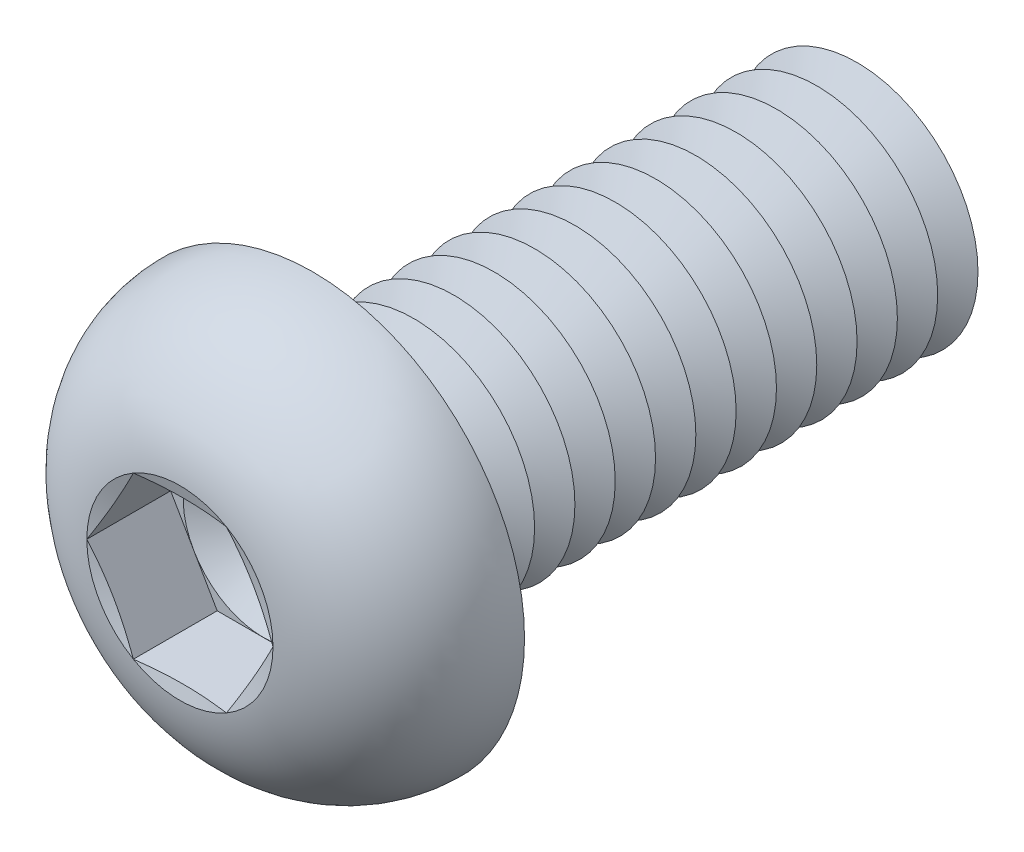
ISO-10303-21;
HEADER;
FILE_DESCRIPTION(('STEP AP214'),'2;1');
FILE_NAME('part.step','',(''),(''),'','','');
FILE_SCHEMA(('AUTOMOTIVE_DESIGN { 1 0 10303 214 1 1 1 1 }'));
ENDSEC;
DATA;
#1=APPLICATION_CONTEXT('core data for automotive mechanical design processes');
#2=APPLICATION_PROTOCOL_DEFINITION('international standard','automotive_design',2000,#1);
#3=PRODUCT_CONTEXT('',#1,'mechanical');
#4=PRODUCT('Part','Part','',(#3));
#5=PRODUCT_RELATED_PRODUCT_CATEGORY('part','',(#4));
#6=PRODUCT_DEFINITION_FORMATION('','',#4);
#7=PRODUCT_DEFINITION_CONTEXT('part definition',#1,'design');
#8=PRODUCT_DEFINITION('design','',#6,#7);
#9=PRODUCT_DEFINITION_SHAPE('','',#8);
#10=(LENGTH_UNIT() NAMED_UNIT(*) SI_UNIT(.MILLI.,.METRE.));
#11=(NAMED_UNIT(*) PLANE_ANGLE_UNIT() SI_UNIT($,.RADIAN.));
#12=(NAMED_UNIT(*) SI_UNIT($,.STERADIAN.) SOLID_ANGLE_UNIT());
#13=UNCERTAINTY_MEASURE_WITH_UNIT(LENGTH_MEASURE(1.E-05),#10,'distance_accuracy_value','');
#14=(GEOMETRIC_REPRESENTATION_CONTEXT(3) GLOBAL_UNCERTAINTY_ASSIGNED_CONTEXT((#13)) GLOBAL_UNIT_ASSIGNED_CONTEXT((#10,
#11,#12)) REPRESENTATION_CONTEXT('',''));
#15=CARTESIAN_POINT('',(0.,0.,0.));
#16=DIRECTION('',(0.,0.,1.));
#17=DIRECTION('',(1.,0.,0.));
#18=AXIS2_PLACEMENT_3D('',#15,#16,#17);
#19=CARTESIAN_POINT('',(0.,0.,1.22));
#20=DIRECTION('',(0.,0.,1.));
#21=DIRECTION('',(1.,0.,0.));
#22=AXIS2_PLACEMENT_3D('',#19,#20,#21);
#23=PLANE('',#22);
#24=CARTESIAN_POINT('',(0.,0.,1.22));
#25=DIRECTION('',(0.,0.,1.));
#26=DIRECTION('',(1.,0.,0.));
#27=AXIS2_PLACEMENT_3D('',#24,#25,#26);
#28=CIRCLE('',#27,1.99999906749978);
#29=CARTESIAN_POINT('',(1.73205,0.999999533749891,1.22));
#30=VERTEX_POINT('',#29);
#31=CARTESIAN_POINT('',(0.,1.99999906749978,1.22));
#32=VERTEX_POINT('',#31);
#33=EDGE_CURVE('E118',#30,#32,#28,.T.);
#34=ORIENTED_EDGE('',*,*,#33,.F.);
#35=DIRECTION('',(-0.5,0.866025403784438,0.));
#36=VECTOR('',#35,1.);
#37=CARTESIAN_POINT('',(2.3094,0.,1.22));
#38=LINE('',#37,#36);
#39=CARTESIAN_POINT('',(1.1547,1.99999906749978,1.22));
#40=VERTEX_POINT('',#39);
#41=EDGE_CURVE('E125',#30,#40,#38,.T.);
#42=ORIENTED_EDGE('',*,*,#41,.T.);
#43=DIRECTION('',(-1.,0.,0.));
#44=VECTOR('',#43,1.);
#45=CARTESIAN_POINT('',(1.1547,1.99999906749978,1.22));
#46=LINE('',#45,#44);
#47=EDGE_CURVE('E136',#40,#32,#46,.T.);
#48=ORIENTED_EDGE('',*,*,#47,.T.);
#49=EDGE_LOOP('',(#34,#42,#48));
#50=FACE_BOUND('',#49,.T.);
#51=ADVANCED_FACE('F39',(#50),#23,.T.);
#52=CARTESIAN_POINT('',(0.,0.,1.22));
#53=DIRECTION('',(0.,0.,1.));
#54=DIRECTION('',(1.,0.,0.));
#55=AXIS2_PLACEMENT_3D('',#52,#53,#54);
#56=CIRCLE('',#55,1.99999906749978);
#57=CARTESIAN_POINT('',(-1.73205,0.999999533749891,1.22));
#58=VERTEX_POINT('',#57);
#59=EDGE_CURVE('E11',#32,#58,#56,.T.);
#60=ORIENTED_EDGE('',*,*,#59,.F.);
#61=CARTESIAN_POINT('',(-1.1547,1.99999906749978,1.22));
#62=VERTEX_POINT('',#61);
#63=EDGE_CURVE('E131',#32,#62,#46,.T.);
#64=ORIENTED_EDGE('',*,*,#63,.T.);
#65=DIRECTION('',(-0.5,-0.866025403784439,0.));
#66=VECTOR('',#65,1.);
#67=CARTESIAN_POINT('',(-1.1547,1.99999906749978,1.22));
#68=LINE('',#67,#66);
#69=EDGE_CURVE('E134',#62,#58,#68,.T.);
#70=ORIENTED_EDGE('',*,*,#69,.T.);
#71=EDGE_LOOP('',(#60,#64,#70));
#72=FACE_BOUND('',#71,.T.);
#73=ADVANCED_FACE('F130',(#72),#23,.T.);
#74=CARTESIAN_POINT('',(-1.73205,-0.999999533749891,1.22));
#75=VERTEX_POINT('',#74);
#76=EDGE_CURVE('E49',#58,#75,#56,.T.);
#77=ORIENTED_EDGE('',*,*,#76,.F.);
#78=CARTESIAN_POINT('',(-2.3094,0.,1.22));
#79=VERTEX_POINT('',#78);
#80=EDGE_CURVE('E143',#58,#79,#68,.T.);
#81=ORIENTED_EDGE('',*,*,#80,.T.);
#82=DIRECTION('',(0.5,-0.866025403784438,0.));
#83=VECTOR('',#82,1.);
#84=CARTESIAN_POINT('',(-2.3094,0.,1.22));
#85=LINE('',#84,#83);
#86=EDGE_CURVE('E152',#79,#75,#85,.T.);
#87=ORIENTED_EDGE('',*,*,#86,.T.);
#88=EDGE_LOOP('',(#77,#81,#87));
#89=FACE_BOUND('',#88,.T.);
#90=ADVANCED_FACE('F380',(#89),#23,.T.);
#91=CARTESIAN_POINT('',(0.,-1.99999906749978,1.22));
#92=VERTEX_POINT('',#91);
#93=EDGE_CURVE('E364',#75,#92,#56,.T.);
#94=ORIENTED_EDGE('',*,*,#93,.F.);
#95=CARTESIAN_POINT('',(-1.1547,-1.99999906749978,1.22));
#96=VERTEX_POINT('',#95);
#97=EDGE_CURVE('E151',#75,#96,#85,.T.);
#98=ORIENTED_EDGE('',*,*,#97,.T.);
#99=DIRECTION('',(1.,0.,0.));
#100=VECTOR('',#99,1.);
#101=CARTESIAN_POINT('',(-1.1547,-1.99999906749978,1.22));
#102=LINE('',#101,#100);
#103=EDGE_CURVE('E157',#96,#92,#102,.T.);
#104=ORIENTED_EDGE('',*,*,#103,.T.);
#105=EDGE_LOOP('',(#94,#98,#104));
#106=FACE_BOUND('',#105,.T.);
#107=ADVANCED_FACE('F374',(#106),#23,.T.);
#108=CARTESIAN_POINT('',(1.73205,-0.999999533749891,1.22));
#109=VERTEX_POINT('',#108);
#110=EDGE_CURVE('E56',#92,#109,#56,.T.);
#111=ORIENTED_EDGE('',*,*,#110,.F.);
#112=CARTESIAN_POINT('',(1.1547,-1.99999906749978,1.22));
#113=VERTEX_POINT('',#112);
#114=EDGE_CURVE('E156',#92,#113,#102,.T.);
#115=ORIENTED_EDGE('',*,*,#114,.T.);
#116=DIRECTION('',(0.5,0.866025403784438,0.));
#117=VECTOR('',#116,1.);
#118=CARTESIAN_POINT('',(1.1547,-1.99999906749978,1.22));
#119=LINE('',#118,#117);
#120=EDGE_CURVE('E162',#113,#109,#119,.T.);
#121=ORIENTED_EDGE('',*,*,#120,.T.);
#122=EDGE_LOOP('',(#111,#115,#121));
#123=FACE_BOUND('',#122,.T.);
#124=ADVANCED_FACE('F452',(#123),#23,.T.);
#125=CARTESIAN_POINT('',(0.,0.,3.3));
#126=DIRECTION('',(0.,0.,1.));
#127=DIRECTION('',(1.,0.,0.));
#128=AXIS2_PLACEMENT_3D('',#125,#126,#127);
#129=CONICAL_SURFACE('',#128,2.3094,1.30899693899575);
#130=CARTESIAN_POINT('',(2.30951547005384,-0.000199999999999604,3.30003094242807));
#131=CARTESIAN_POINT('',(2.26155412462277,0.0828714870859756,3.2871729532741));
#132=CARTESIAN_POINT('',(2.21350580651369,0.16609361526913,3.27549992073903));
#133=CARTESIAN_POINT('',(2.11723944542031,0.332831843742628,3.2549913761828));
#134=CARTESIAN_POINT('',(2.06902134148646,0.416348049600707,3.24615701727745));
#135=CARTESIAN_POINT('',(1.97270782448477,0.583167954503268,3.23184167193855));
#136=CARTESIAN_POINT('',(1.92461306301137,0.666470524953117,3.22634360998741));
#137=CARTESIAN_POINT('',(1.82836219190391,0.83318192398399,3.21897125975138));
#138=CARTESIAN_POINT('',(1.78020609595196,0.91659072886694,3.21709626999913));
#139=CARTESIAN_POINT('',(1.68389390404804,1.08340833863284,3.21709626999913));
#140=CARTESIAN_POINT('',(1.63573780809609,1.16681714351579,3.21897125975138));
#141=CARTESIAN_POINT('',(1.53948693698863,1.33352854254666,3.22634360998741));
#142=CARTESIAN_POINT('',(1.49139217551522,1.41683111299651,3.23184167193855));
#143=CARTESIAN_POINT('',(1.39507865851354,1.58365101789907,3.24615701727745));
#144=CARTESIAN_POINT('',(1.34686055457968,1.66716722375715,3.2549913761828));
#145=CARTESIAN_POINT('',(1.25059419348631,1.83390545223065,3.27549992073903));
#146=CARTESIAN_POINT('',(1.20254587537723,1.91712758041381,3.2871729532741));
#147=CARTESIAN_POINT('',(1.15458452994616,2.00019906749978,3.30003094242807));
#148=B_SPLINE_CURVE_WITH_KNOTS('',3,(#130,#131,#132,#133,#134,#135,#136,#137,#138,#139,#140,
#141,#142,#143,#144,#145,#146,#147),.UNSPECIFIED.,.F.,.F.,(4,2,2,2,2,2,2,2,4),(0.,
0.290357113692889,0.580832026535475,0.869807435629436,1.15872689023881,1.44764634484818,
1.73662175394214,2.02709666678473,2.31745378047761),.UNSPECIFIED.);
#149=CARTESIAN_POINT('',(2.3094,0.,3.3));
#150=VERTEX_POINT('',#149);
#151=CARTESIAN_POINT('',(1.15469999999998,1.99999906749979,3.3));
#152=VERTEX_POINT('',#151);
#153=EDGE_CURVE('E221',#150,#152,#148,.T.);
#154=ORIENTED_EDGE('',*,*,#153,.F.);
#155=CARTESIAN_POINT('',(0.,0.,3.3));
#156=DIRECTION('',(0.,0.,-1.));
#157=DIRECTION('',(-1.,0.,0.));
#158=AXIS2_PLACEMENT_3D('',#155,#156,#157);
#159=CIRCLE('',#158,2.3094);
#160=EDGE_CURVE('E409',#152,#150,#159,.T.);
#161=ORIENTED_EDGE('',*,*,#160,.F.);
#162=EDGE_LOOP('',(#154,#161));
#163=FACE_BOUND('',#162,.T.);
#164=ADVANCED_FACE('F456',(#163),#129,.F.);
#165=CARTESIAN_POINT('',(1.15458452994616,-2.00019906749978,3.30003094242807));
#166=CARTESIAN_POINT('',(1.20254587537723,-1.91712758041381,3.2871729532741));
#167=CARTESIAN_POINT('',(1.25059419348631,-1.83390545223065,3.27549992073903));
#168=CARTESIAN_POINT('',(1.34686055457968,-1.66716722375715,3.2549913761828));
#169=CARTESIAN_POINT('',(1.39507865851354,-1.58365101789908,3.24615701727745));
#170=CARTESIAN_POINT('',(1.49139217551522,-1.41683111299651,3.23184167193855));
#171=CARTESIAN_POINT('',(1.53948693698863,-1.33352854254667,3.22634360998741));
#172=CARTESIAN_POINT('',(1.63573780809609,-1.16681714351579,3.21897125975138));
#173=CARTESIAN_POINT('',(1.68389390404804,-1.08340833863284,3.21709626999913));
#174=CARTESIAN_POINT('',(1.78020609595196,-0.916590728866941,3.21709626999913));
#175=CARTESIAN_POINT('',(1.82836219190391,-0.833181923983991,3.21897125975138));
#176=CARTESIAN_POINT('',(1.92461306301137,-0.666470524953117,3.22634360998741));
#177=CARTESIAN_POINT('',(1.97270782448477,-0.583167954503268,3.23184167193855));
#178=CARTESIAN_POINT('',(2.06902134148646,-0.416348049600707,3.24615701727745));
#179=CARTESIAN_POINT('',(2.11723944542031,-0.332831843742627,3.2549913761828));
#180=CARTESIAN_POINT('',(2.21350580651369,-0.166093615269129,3.27549992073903));
#181=CARTESIAN_POINT('',(2.26155412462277,-0.0828714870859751,3.2871729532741));
#182=CARTESIAN_POINT('',(2.30951547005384,0.000200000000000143,3.30003094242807));
#183=B_SPLINE_CURVE_WITH_KNOTS('',3,(#165,#166,#167,#168,#169,#170,#171,#172,#173,#174,#175,
#176,#177,#178,#179,#180,#181,#182),.UNSPECIFIED.,.F.,.F.,(4,2,2,2,2,2,2,2,4),(0.,
0.290357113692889,0.580832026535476,0.869807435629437,1.15872689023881,1.44764634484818,
1.73662175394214,2.02709666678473,2.31745378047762),.UNSPECIFIED.);
#184=CARTESIAN_POINT('',(1.1547,-1.99999906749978,3.3));
#185=VERTEX_POINT('',#184);
#186=EDGE_CURVE('E230',#185,#150,#183,.T.);
#187=ORIENTED_EDGE('',*,*,#186,.F.);
#188=EDGE_CURVE('E411',#150,#185,#159,.T.);
#189=ORIENTED_EDGE('',*,*,#188,.F.);
#190=EDGE_LOOP('',(#187,#189));
#191=FACE_BOUND('',#190,.T.);
#192=ADVANCED_FACE('F416',(#191),#129,.F.);
#193=CARTESIAN_POINT('',(-3.4849337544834,-1.99999906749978,3.75783251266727));
#194=CARTESIAN_POINT('',(-3.40057136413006,-1.99999906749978,3.73822859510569));
#195=CARTESIAN_POINT('',(-3.31617090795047,-1.99999906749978,3.71878852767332));
#196=CARTESIAN_POINT('',(-3.14727791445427,-1.99999906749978,3.68030638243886));
#197=CARTESIAN_POINT('',(-3.06278537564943,-1.99999906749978,3.66126431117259));
#198=CARTESIAN_POINT('',(-2.80911712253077,-1.99999906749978,3.60483420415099));
#199=CARTESIAN_POINT('',(-2.63978343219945,-1.99999906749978,3.5681499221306));
#200=CARTESIAN_POINT('',(-2.29895421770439,-1.99999906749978,3.49717072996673));
#201=CARTESIAN_POINT('',(-2.12745330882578,-1.99999906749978,3.4629014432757));
#202=CARTESIAN_POINT('',(-1.78364663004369,-1.99999906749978,3.39849485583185));
#203=CARTESIAN_POINT('',(-1.61134079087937,-1.99999906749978,3.36835791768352));
#204=CARTESIAN_POINT('',(-1.27040784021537,-1.99999906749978,3.31501553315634));
#205=CARTESIAN_POINT('',(-1.10180724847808,-1.99999906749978,3.291644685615));
#206=CARTESIAN_POINT('',(-0.763641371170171,-1.99999906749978,3.2533727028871));
#207=CARTESIAN_POINT('',(-0.594076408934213,-1.99999906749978,3.23846888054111));
#208=CARTESIAN_POINT('',(-0.339649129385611,-1.99999906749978,3.22431372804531));
#209=CARTESIAN_POINT('',(-0.255009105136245,-1.99999906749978,3.22096057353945));
#210=CARTESIAN_POINT('',(-0.0856618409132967,-1.99999906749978,3.21711210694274));
#211=CARTESIAN_POINT('',(-0.000954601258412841,-1.99999906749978,3.2166167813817));
#212=CARTESIAN_POINT('',(0.168430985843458,-1.99999906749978,3.21851478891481));
#213=CARTESIAN_POINT('',(0.25310933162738,-1.99999906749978,3.2209082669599));
#214=CARTESIAN_POINT('',(0.422344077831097,-1.99999906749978,3.22845792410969));
#215=CARTESIAN_POINT('',(0.506900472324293,-1.99999906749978,3.23361423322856));
#216=CARTESIAN_POINT('',(0.712240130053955,-1.99999906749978,3.24921577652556));
#217=CARTESIAN_POINT('',(0.832922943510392,-1.99999906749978,3.26098285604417));
#218=CARTESIAN_POINT('',(1.07378161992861,-1.99999906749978,3.28874908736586));
#219=CARTESIAN_POINT('',(1.1939575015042,-1.99999906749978,3.30474808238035));
#220=CARTESIAN_POINT('',(1.43419655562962,-1.99999906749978,3.34009172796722));
#221=CARTESIAN_POINT('',(1.55425817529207,-1.99999906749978,3.35944677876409));
#222=CARTESIAN_POINT('',(1.79394991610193,-1.99999906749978,3.40067076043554));
#223=CARTESIAN_POINT('',(1.91358001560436,-1.99999906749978,3.42253981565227));
#224=CARTESIAN_POINT('',(2.15493405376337,-1.99999906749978,3.46864194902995));
#225=CARTESIAN_POINT('',(2.27665041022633,-1.99999906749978,3.49291441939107));
#226=CARTESIAN_POINT('',(2.51977680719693,-1.99999906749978,3.54294628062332));
#227=CARTESIAN_POINT('',(2.64118684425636,-1.99999906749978,3.56870568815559));
#228=CARTESIAN_POINT('',(2.88310060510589,-1.99999906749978,3.62120891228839));
#229=CARTESIAN_POINT('',(3.00360566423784,-1.99999906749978,3.6479466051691));
#230=CARTESIAN_POINT('',(3.24441021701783,-1.99999906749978,3.7022947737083));
#231=CARTESIAN_POINT('',(3.36470972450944,-1.99999906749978,3.72990518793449));
#232=CARTESIAN_POINT('',(3.4849337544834,-1.99999906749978,3.75783251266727));
#233=B_SPLINE_CURVE_WITH_KNOTS('',3,(#193,#194,#195,#196,#197,#198,#199,#200,#201,#202,#203,
#204,#205,#206,#207,#208,#209,#210,#211,#212,#213,#214,#215,#216,#217,#218,#219,#220,#221,#222,
#223,#224,#225,#226,#227,#228,#229,#230,#231,#232),.UNSPECIFIED.,.F.,.F.,(4,2,2,2,2,2,2,2,2,2,2,
2,2,2,2,2,2,2,2,4),(0.,0.259830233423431,0.519664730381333,1.03943435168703,1.56407662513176,
2.08876490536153,2.59926476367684,3.10960251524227,3.36367930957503,3.61775490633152,
3.87184325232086,4.1259435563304,4.48960924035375,4.85326145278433,5.21806142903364,
5.58287945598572,5.95520617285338,6.32753706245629,6.69784064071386,7.06811821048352),.UNSPECIFIED.);
#234=CARTESIAN_POINT('',(-1.1547,-1.99999906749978,3.3));
#235=VERTEX_POINT('',#234);
#236=EDGE_CURVE('E392',#235,#185,#233,.T.);
#237=ORIENTED_EDGE('',*,*,#236,.F.);
#238=EDGE_CURVE('E400',#185,#235,#159,.T.);
#239=ORIENTED_EDGE('',*,*,#238,.F.);
#240=EDGE_LOOP('',(#237,#239));
#241=FACE_BOUND('',#240,.T.);
#242=ADVANCED_FACE('F422',(#241),#129,.F.);
#243=CARTESIAN_POINT('',(-2.30951547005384,0.000200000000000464,3.30003094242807));
#244=CARTESIAN_POINT('',(-2.26155412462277,-0.0828714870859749,3.2871729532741));
#245=CARTESIAN_POINT('',(-2.21350580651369,-0.166093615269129,3.27549992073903));
#246=CARTESIAN_POINT('',(-2.11723944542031,-0.332831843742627,3.2549913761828));
#247=CARTESIAN_POINT('',(-2.06902134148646,-0.416348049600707,3.24615701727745));
#248=CARTESIAN_POINT('',(-1.97270782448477,-0.583167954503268,3.23184167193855));
#249=CARTESIAN_POINT('',(-1.92461306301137,-0.666470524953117,3.22634360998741));
#250=CARTESIAN_POINT('',(-1.82836219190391,-0.833181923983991,3.21897125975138));
#251=CARTESIAN_POINT('',(-1.78020609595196,-0.916590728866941,3.21709626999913));
#252=CARTESIAN_POINT('',(-1.68389390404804,-1.08340833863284,3.21709626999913));
#253=CARTESIAN_POINT('',(-1.63573780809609,-1.16681714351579,3.21897125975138));
#254=CARTESIAN_POINT('',(-1.53948693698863,-1.33352854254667,3.22634360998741));
#255=CARTESIAN_POINT('',(-1.49139217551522,-1.41683111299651,3.23184167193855));
#256=CARTESIAN_POINT('',(-1.39507865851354,-1.58365101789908,3.24615701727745));
#257=CARTESIAN_POINT('',(-1.34686055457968,-1.66716722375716,3.2549913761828));
#258=CARTESIAN_POINT('',(-1.25059419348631,-1.83390545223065,3.27549992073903));
#259=CARTESIAN_POINT('',(-1.20254587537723,-1.91712758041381,3.2871729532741));
#260=CARTESIAN_POINT('',(-1.15458452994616,-2.00019906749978,3.30003094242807));
#261=B_SPLINE_CURVE_WITH_KNOTS('',3,(#243,#244,#245,#246,#247,#248,#249,#250,#251,#252,#253,
#254,#255,#256,#257,#258,#259,#260),.UNSPECIFIED.,.F.,.F.,(4,2,2,2,2,2,2,2,4),(0.,
0.290357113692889,0.580832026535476,0.869807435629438,1.15872689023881,1.44764634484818,
1.73662175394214,2.02709666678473,2.31745378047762),.UNSPECIFIED.);
#262=CARTESIAN_POINT('',(-2.3094,0.,3.3));
#263=VERTEX_POINT('',#262);
#264=EDGE_CURVE('E385',#263,#235,#261,.T.);
#265=ORIENTED_EDGE('',*,*,#264,.F.);
#266=EDGE_CURVE('E347',#235,#263,#159,.T.);
#267=ORIENTED_EDGE('',*,*,#266,.F.);
#268=EDGE_LOOP('',(#265,#267));
#269=FACE_BOUND('',#268,.T.);
#270=ADVANCED_FACE('F389',(#269),#129,.F.);
#271=CARTESIAN_POINT('',(-1.15458452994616,2.00019906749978,3.30003094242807));
#272=CARTESIAN_POINT('',(-1.20254587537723,1.91712758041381,3.2871729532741));
#273=CARTESIAN_POINT('',(-1.25059419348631,1.83390545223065,3.27549992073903));
#274=CARTESIAN_POINT('',(-1.34686055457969,1.66716722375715,3.2549913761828));
#275=CARTESIAN_POINT('',(-1.39507865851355,1.58365101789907,3.24615701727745));
#276=CARTESIAN_POINT('',(-1.49139217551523,1.41683111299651,3.23184167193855));
#277=CARTESIAN_POINT('',(-1.53948693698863,1.33352854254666,3.22634360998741));
#278=CARTESIAN_POINT('',(-1.63573780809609,1.16681714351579,3.21897125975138));
#279=CARTESIAN_POINT('',(-1.68389390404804,1.08340833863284,3.21709626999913));
#280=CARTESIAN_POINT('',(-1.78020609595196,0.91659072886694,3.21709626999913));
#281=CARTESIAN_POINT('',(-1.82836219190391,0.83318192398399,3.21897125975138));
#282=CARTESIAN_POINT('',(-1.92461306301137,0.666470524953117,3.22634360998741));
#283=CARTESIAN_POINT('',(-1.97270782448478,0.583167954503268,3.23184167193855));
#284=CARTESIAN_POINT('',(-2.06902134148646,0.416348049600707,3.24615701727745));
#285=CARTESIAN_POINT('',(-2.11723944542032,0.332831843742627,3.2549913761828));
#286=CARTESIAN_POINT('',(-2.21350580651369,0.166093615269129,3.27549992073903));
#287=CARTESIAN_POINT('',(-2.26155412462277,0.0828714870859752,3.2871729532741));
#288=CARTESIAN_POINT('',(-2.30951547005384,-0.000200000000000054,3.30003094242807));
#289=B_SPLINE_CURVE_WITH_KNOTS('',3,(#271,#272,#273,#274,#275,#276,#277,#278,#279,#280,#281,
#282,#283,#284,#285,#286,#287,#288),.UNSPECIFIED.,.F.,.F.,(4,2,2,2,2,2,2,2,4),(0.,
0.290357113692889,0.580832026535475,0.869807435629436,1.15872689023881,1.44764634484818,
1.73662175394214,2.02709666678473,2.31745378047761),.UNSPECIFIED.);
#290=CARTESIAN_POINT('',(-1.1547,1.99999906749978,3.3));
#291=VERTEX_POINT('',#290);
#292=EDGE_CURVE('E195',#291,#263,#289,.T.);
#293=ORIENTED_EDGE('',*,*,#292,.F.);
#294=EDGE_CURVE('E348',#263,#291,#159,.T.);
#295=ORIENTED_EDGE('',*,*,#294,.F.);
#296=EDGE_LOOP('',(#293,#295));
#297=FACE_BOUND('',#296,.T.);
#298=ADVANCED_FACE('F402',(#297),#129,.F.);
#299=CARTESIAN_POINT('',(0.,0.,-10.5));
#300=DIRECTION('',(0.,0.,1.));
#301=DIRECTION('',(1.,0.,0.));
#302=AXIS2_PLACEMENT_3D('',#299,#300,#301);
#303=CONICAL_SURFACE('',#302,3.,1.0471975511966);
#304=CARTESIAN_POINT('',(0.,0.,-11.));
#305=DIRECTION('',(0.,0.,1.));
#306=DIRECTION('',(1.,0.,0.));
#307=AXIS2_PLACEMENT_3D('',#304,#305,#306);
#308=CIRCLE('',#307,2.13397459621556);
#309=CARTESIAN_POINT('',(2.13397459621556,0.,-11.));
#310=VERTEX_POINT('',#309);
#311=EDGE_CURVE('E320',#310,#310,#308,.T.);
#312=ORIENTED_EDGE('',*,*,#311,.T.);
#313=EDGE_LOOP('',(#312));
#314=FACE_BOUND('',#313,.T.);
#315=CARTESIAN_POINT('',(0.,0.,-10.5));
#316=DIRECTION('',(0.,0.,1.));
#317=DIRECTION('',(1.,0.,0.));
#318=AXIS2_PLACEMENT_3D('',#315,#316,#317);
#319=CIRCLE('',#318,3.);
#320=CARTESIAN_POINT('',(3.,0.,-10.5));
#321=VERTEX_POINT('',#320);
#322=EDGE_CURVE('E316',#321,#321,#319,.T.);
#323=ORIENTED_EDGE('',*,*,#322,.F.);
#324=EDGE_LOOP('',(#323));
#325=FACE_BOUND('',#324,.T.);
#326=ADVANCED_FACE('F590',(#314,#325),#303,.T.);
#327=CARTESIAN_POINT('',(0.,0.,-11.));
#328=DIRECTION('',(0.,0.,-1.));
#329=DIRECTION('',(-1.,0.,0.));
#330=AXIS2_PLACEMENT_3D('',#327,#328,#329);
#331=CONICAL_SURFACE('',#330,2.13397459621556,1.0471975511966);
#332=CARTESIAN_POINT('',(0.,0.,-11.5));
#333=DIRECTION('',(0.,0.,1.));
#334=DIRECTION('',(1.,0.,0.));
#335=AXIS2_PLACEMENT_3D('',#332,#333,#334);
#336=CIRCLE('',#335,3.);
#337=CARTESIAN_POINT('',(3.,0.,-11.5));
#338=VERTEX_POINT('',#337);
#339=EDGE_CURVE('E324',#338,#338,#336,.T.);
#340=ORIENTED_EDGE('',*,*,#339,.T.);
#341=EDGE_LOOP('',(#340));
#342=FACE_BOUND('',#341,.T.);
#343=ORIENTED_EDGE('',*,*,#311,.F.);
#344=EDGE_LOOP('',(#343));
#345=FACE_BOUND('',#344,.T.);
#346=ADVANCED_FACE('F832',(#342,#345),#331,.T.);
#347=CARTESIAN_POINT('',(0.,3.00000000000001,-14.));
#348=DIRECTION('',(0.,0.,-1.));
#349=DIRECTION('',(-1.,0.,0.));
#350=AXIS2_PLACEMENT_3D('',#347,#348,#349);
#351=PLANE('',#350);
#352=CARTESIAN_POINT('',(0.,0.,-14.));
#353=DIRECTION('',(0.,0.,1.));
#354=DIRECTION('',(1.,0.,0.));
#355=AXIS2_PLACEMENT_3D('',#352,#353,#354);
#356=CIRCLE('',#355,2.13397459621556);
#357=CARTESIAN_POINT('',(2.13397459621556,0.,-14.));
#358=VERTEX_POINT('',#357);
#359=EDGE_CURVE('E343',#358,#358,#356,.T.);
#360=ORIENTED_EDGE('',*,*,#359,.F.);
#361=EDGE_LOOP('',(#360));
#362=FACE_BOUND('',#361,.T.);
#363=ADVANCED_FACE('F837',(#362),#351,.T.);
#364=CARTESIAN_POINT('',(0.,0.,-13.5));
#365=DIRECTION('',(0.,0.,1.));
#366=DIRECTION('',(1.,0.,0.));
#367=AXIS2_PLACEMENT_3D('',#364,#365,#366);
#368=CONICAL_SURFACE('',#367,3.,1.0471975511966);
#369=ORIENTED_EDGE('',*,*,#359,.T.);
#370=EDGE_LOOP('',(#369));
#371=FACE_BOUND('',#370,.T.);
#372=CARTESIAN_POINT('',(0.,0.,-13.5));
#373=DIRECTION('',(0.,0.,1.));
#374=DIRECTION('',(1.,0.,0.));
#375=AXIS2_PLACEMENT_3D('',#372,#373,#374);
#376=CIRCLE('',#375,3.);
#377=CARTESIAN_POINT('',(3.,0.,-13.5));
#378=VERTEX_POINT('',#377);
#379=EDGE_CURVE('E339',#378,#378,#376,.T.);
#380=ORIENTED_EDGE('',*,*,#379,.F.);
#381=EDGE_LOOP('',(#380));
#382=FACE_BOUND('',#381,.T.);
#383=ADVANCED_FACE('F826',(#371,#382),#368,.T.);
#384=CARTESIAN_POINT('',(0.,0.,-13.));
#385=DIRECTION('',(0.,0.,-1.));
#386=DIRECTION('',(-1.,0.,0.));
#387=AXIS2_PLACEMENT_3D('',#384,#385,#386);
#388=CONICAL_SURFACE('',#387,2.13397459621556,1.0471975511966);
#389=ORIENTED_EDGE('',*,*,#379,.T.);
#390=EDGE_LOOP('',(#389));
#391=FACE_BOUND('',#390,.T.);
#392=CARTESIAN_POINT('',(0.,0.,-13.));
#393=DIRECTION('',(0.,0.,1.));
#394=DIRECTION('',(1.,0.,0.));
#395=AXIS2_PLACEMENT_3D('',#392,#393,#394);
#396=CIRCLE('',#395,2.13397459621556);
#397=CARTESIAN_POINT('',(2.13397459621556,0.,-13.));
#398=VERTEX_POINT('',#397);
#399=EDGE_CURVE('E335',#398,#398,#396,.T.);
#400=ORIENTED_EDGE('',*,*,#399,.F.);
#401=EDGE_LOOP('',(#400));
#402=FACE_BOUND('',#401,.T.);
#403=ADVANCED_FACE('F816',(#391,#402),#388,.T.);
#404=CARTESIAN_POINT('',(0.,0.,-12.5));
#405=DIRECTION('',(0.,0.,1.));
#406=DIRECTION('',(1.,0.,0.));
#407=AXIS2_PLACEMENT_3D('',#404,#405,#406);
#408=CONICAL_SURFACE('',#407,3.,1.0471975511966);
#409=ORIENTED_EDGE('',*,*,#399,.T.);
#410=EDGE_LOOP('',(#409));
#411=FACE_BOUND('',#410,.T.);
#412=CARTESIAN_POINT('',(0.,0.,-12.5));
#413=DIRECTION('',(0.,0.,1.));
#414=DIRECTION('',(1.,0.,0.));
#415=AXIS2_PLACEMENT_3D('',#412,#413,#414);
#416=CIRCLE('',#415,3.);
#417=CARTESIAN_POINT('',(3.,0.,-12.5));
#418=VERTEX_POINT('',#417);
#419=EDGE_CURVE('E331',#418,#418,#416,.T.);
#420=ORIENTED_EDGE('',*,*,#419,.F.);
#421=EDGE_LOOP('',(#420));
#422=FACE_BOUND('',#421,.T.);
#423=ADVANCED_FACE('F806',(#411,#422),#408,.T.);
#424=CARTESIAN_POINT('',(0.,0.,-12.));
#425=DIRECTION('',(0.,0.,-1.));
#426=DIRECTION('',(-1.,0.,0.));
#427=AXIS2_PLACEMENT_3D('',#424,#425,#426);
#428=CONICAL_SURFACE('',#427,2.13397459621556,1.0471975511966);
#429=ORIENTED_EDGE('',*,*,#419,.T.);
#430=EDGE_LOOP('',(#429));
#431=FACE_BOUND('',#430,.T.);
#432=CARTESIAN_POINT('',(0.,0.,-12.));
#433=DIRECTION('',(0.,0.,1.));
#434=DIRECTION('',(1.,0.,0.));
#435=AXIS2_PLACEMENT_3D('',#432,#433,#434);
#436=CIRCLE('',#435,2.13397459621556);
#437=CARTESIAN_POINT('',(2.13397459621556,0.,-12.));
#438=VERTEX_POINT('',#437);
#439=EDGE_CURVE('E328',#438,#438,#436,.T.);
#440=ORIENTED_EDGE('',*,*,#439,.F.);
#441=EDGE_LOOP('',(#440));
#442=FACE_BOUND('',#441,.T.);
#443=ADVANCED_FACE('F796',(#431,#442),#428,.T.);
#444=CARTESIAN_POINT('',(0.,0.,-11.5));
#445=DIRECTION('',(0.,0.,1.));
#446=DIRECTION('',(1.,0.,0.));
#447=AXIS2_PLACEMENT_3D('',#444,#445,#446);
#448=CONICAL_SURFACE('',#447,3.,1.0471975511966);
#449=ORIENTED_EDGE('',*,*,#439,.T.);
#450=EDGE_LOOP('',(#449));
#451=FACE_BOUND('',#450,.T.);
#452=ORIENTED_EDGE('',*,*,#339,.F.);
#453=EDGE_LOOP('',(#452));
#454=FACE_BOUND('',#453,.T.);
#455=ADVANCED_FACE('F786',(#451,#454),#448,.T.);
#456=CARTESIAN_POINT('',(0.,0.,-9.5));
#457=DIRECTION('',(0.,0.,1.));
#458=DIRECTION('',(1.,0.,0.));
#459=AXIS2_PLACEMENT_3D('',#456,#457,#458);
#460=CONICAL_SURFACE('',#459,3.,1.0471975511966);
#461=CARTESIAN_POINT('',(0.,0.,-10.));
#462=DIRECTION('',(0.,0.,1.));
#463=DIRECTION('',(1.,0.,0.));
#464=AXIS2_PLACEMENT_3D('',#461,#462,#463);
#465=CIRCLE('',#464,2.13397459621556);
#466=CARTESIAN_POINT('',(2.13397459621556,0.,-10.));
#467=VERTEX_POINT('',#466);
#468=EDGE_CURVE('E312',#467,#467,#465,.T.);
#469=ORIENTED_EDGE('',*,*,#468,.T.);
#470=EDGE_LOOP('',(#469));
#471=FACE_BOUND('',#470,.T.);
#472=CARTESIAN_POINT('',(0.,0.,-9.5));
#473=DIRECTION('',(0.,0.,1.));
#474=DIRECTION('',(1.,0.,0.));
#475=AXIS2_PLACEMENT_3D('',#472,#473,#474);
#476=CIRCLE('',#475,3.);
#477=CARTESIAN_POINT('',(3.,0.,-9.5));
#478=VERTEX_POINT('',#477);
#479=EDGE_CURVE('E308',#478,#478,#476,.T.);
#480=ORIENTED_EDGE('',*,*,#479,.F.);
#481=EDGE_LOOP('',(#480));
#482=FACE_BOUND('',#481,.T.);
#483=ADVANCED_FACE('F776',(#471,#482),#460,.T.);
#484=CARTESIAN_POINT('',(0.,0.,-10.));
#485=DIRECTION('',(0.,0.,-1.));
#486=DIRECTION('',(-1.,0.,0.));
#487=AXIS2_PLACEMENT_3D('',#484,#485,#486);
#488=CONICAL_SURFACE('',#487,2.13397459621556,1.0471975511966);
#489=ORIENTED_EDGE('',*,*,#322,.T.);
#490=EDGE_LOOP('',(#489));
#491=FACE_BOUND('',#490,.T.);
#492=ORIENTED_EDGE('',*,*,#468,.F.);
#493=EDGE_LOOP('',(#492));
#494=FACE_BOUND('',#493,.T.);
#495=ADVANCED_FACE('F766',(#491,#494),#488,.T.);
#496=CARTESIAN_POINT('',(0.,0.,-8.5));
#497=DIRECTION('',(0.,0.,1.));
#498=DIRECTION('',(1.,0.,0.));
#499=AXIS2_PLACEMENT_3D('',#496,#497,#498);
#500=CONICAL_SURFACE('',#499,3.,1.0471975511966);
#501=CARTESIAN_POINT('',(0.,0.,-9.));
#502=DIRECTION('',(0.,0.,1.));
#503=DIRECTION('',(1.,0.,0.));
#504=AXIS2_PLACEMENT_3D('',#501,#502,#503);
#505=CIRCLE('',#504,2.13397459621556);
#506=CARTESIAN_POINT('',(2.13397459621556,0.,-9.));
#507=VERTEX_POINT('',#506);
#508=EDGE_CURVE('E304',#507,#507,#505,.T.);
#509=ORIENTED_EDGE('',*,*,#508,.T.);
#510=EDGE_LOOP('',(#509));
#511=FACE_BOUND('',#510,.T.);
#512=CARTESIAN_POINT('',(0.,0.,-8.5));
#513=DIRECTION('',(0.,0.,1.));
#514=DIRECTION('',(1.,0.,0.));
#515=AXIS2_PLACEMENT_3D('',#512,#513,#514);
#516=CIRCLE('',#515,3.);
#517=CARTESIAN_POINT('',(3.,0.,-8.5));
#518=VERTEX_POINT('',#517);
#519=EDGE_CURVE('E300',#518,#518,#516,.T.);
#520=ORIENTED_EDGE('',*,*,#519,.F.);
#521=EDGE_LOOP('',(#520));
#522=FACE_BOUND('',#521,.T.);
#523=ADVANCED_FACE('F756',(#511,#522),#500,.T.);
#524=CARTESIAN_POINT('',(0.,0.,-9.));
#525=DIRECTION('',(0.,0.,-1.));
#526=DIRECTION('',(-1.,0.,0.));
#527=AXIS2_PLACEMENT_3D('',#524,#525,#526);
#528=CONICAL_SURFACE('',#527,2.13397459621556,1.0471975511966);
#529=ORIENTED_EDGE('',*,*,#479,.T.);
#530=EDGE_LOOP('',(#529));
#531=FACE_BOUND('',#530,.T.);
#532=ORIENTED_EDGE('',*,*,#508,.F.);
#533=EDGE_LOOP('',(#532));
#534=FACE_BOUND('',#533,.T.);
#535=ADVANCED_FACE('F746',(#531,#534),#528,.T.);
#536=CARTESIAN_POINT('',(0.,0.,-7.5));
#537=DIRECTION('',(0.,0.,1.));
#538=DIRECTION('',(1.,0.,0.));
#539=AXIS2_PLACEMENT_3D('',#536,#537,#538);
#540=CONICAL_SURFACE('',#539,3.,1.0471975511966);
#541=CARTESIAN_POINT('',(0.,0.,-8.));
#542=DIRECTION('',(0.,0.,1.));
#543=DIRECTION('',(1.,0.,0.));
#544=AXIS2_PLACEMENT_3D('',#541,#542,#543);
#545=CIRCLE('',#544,2.13397459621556);
#546=CARTESIAN_POINT('',(2.13397459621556,0.,-8.));
#547=VERTEX_POINT('',#546);
#548=EDGE_CURVE('E296',#547,#547,#545,.T.);
#549=ORIENTED_EDGE('',*,*,#548,.T.);
#550=EDGE_LOOP('',(#549));
#551=FACE_BOUND('',#550,.T.);
#552=CARTESIAN_POINT('',(0.,0.,-7.5));
#553=DIRECTION('',(0.,0.,1.));
#554=DIRECTION('',(1.,0.,0.));
#555=AXIS2_PLACEMENT_3D('',#552,#553,#554);
#556=CIRCLE('',#555,3.);
#557=CARTESIAN_POINT('',(3.,0.,-7.5));
#558=VERTEX_POINT('',#557);
#559=EDGE_CURVE('E292',#558,#558,#556,.T.);
#560=ORIENTED_EDGE('',*,*,#559,.F.);
#561=EDGE_LOOP('',(#560));
#562=FACE_BOUND('',#561,.T.);
#563=ADVANCED_FACE('F736',(#551,#562),#540,.T.);
#564=CARTESIAN_POINT('',(0.,0.,-8.));
#565=DIRECTION('',(0.,0.,-1.));
#566=DIRECTION('',(-1.,0.,0.));
#567=AXIS2_PLACEMENT_3D('',#564,#565,#566);
#568=CONICAL_SURFACE('',#567,2.13397459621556,1.0471975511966);
#569=ORIENTED_EDGE('',*,*,#519,.T.);
#570=EDGE_LOOP('',(#569));
#571=FACE_BOUND('',#570,.T.);
#572=ORIENTED_EDGE('',*,*,#548,.F.);
#573=EDGE_LOOP('',(#572));
#574=FACE_BOUND('',#573,.T.);
#575=ADVANCED_FACE('F726',(#571,#574),#568,.T.);
#576=CARTESIAN_POINT('',(0.,0.,-6.5));
#577=DIRECTION('',(0.,0.,1.));
#578=DIRECTION('',(1.,0.,0.));
#579=AXIS2_PLACEMENT_3D('',#576,#577,#578);
#580=CONICAL_SURFACE('',#579,3.,1.0471975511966);
#581=CARTESIAN_POINT('',(0.,0.,-7.));
#582=DIRECTION('',(0.,0.,1.));
#583=DIRECTION('',(1.,0.,0.));
#584=AXIS2_PLACEMENT_3D('',#581,#582,#583);
#585=CIRCLE('',#584,2.13397459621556);
#586=CARTESIAN_POINT('',(2.13397459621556,0.,-7.));
#587=VERTEX_POINT('',#586);
#588=EDGE_CURVE('E288',#587,#587,#585,.T.);
#589=ORIENTED_EDGE('',*,*,#588,.T.);
#590=EDGE_LOOP('',(#589));
#591=FACE_BOUND('',#590,.T.);
#592=CARTESIAN_POINT('',(0.,0.,-6.5));
#593=DIRECTION('',(0.,0.,1.));
#594=DIRECTION('',(1.,0.,0.));
#595=AXIS2_PLACEMENT_3D('',#592,#593,#594);
#596=CIRCLE('',#595,3.);
#597=CARTESIAN_POINT('',(3.,0.,-6.5));
#598=VERTEX_POINT('',#597);
#599=EDGE_CURVE('E284',#598,#598,#596,.T.);
#600=ORIENTED_EDGE('',*,*,#599,.F.);
#601=EDGE_LOOP('',(#600));
#602=FACE_BOUND('',#601,.T.);
#603=ADVANCED_FACE('F716',(#591,#602),#580,.T.);
#604=CARTESIAN_POINT('',(0.,0.,-7.));
#605=DIRECTION('',(0.,0.,-1.));
#606=DIRECTION('',(-1.,0.,0.));
#607=AXIS2_PLACEMENT_3D('',#604,#605,#606);
#608=CONICAL_SURFACE('',#607,2.13397459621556,1.0471975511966);
#609=ORIENTED_EDGE('',*,*,#559,.T.);
#610=EDGE_LOOP('',(#609));
#611=FACE_BOUND('',#610,.T.);
#612=ORIENTED_EDGE('',*,*,#588,.F.);
#613=EDGE_LOOP('',(#612));
#614=FACE_BOUND('',#613,.T.);
#615=ADVANCED_FACE('F706',(#611,#614),#608,.T.);
#616=CARTESIAN_POINT('',(0.,0.,-5.5));
#617=DIRECTION('',(0.,0.,1.));
#618=DIRECTION('',(1.,0.,0.));
#619=AXIS2_PLACEMENT_3D('',#616,#617,#618);
#620=CONICAL_SURFACE('',#619,3.,1.0471975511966);
#621=CARTESIAN_POINT('',(0.,0.,-6.));
#622=DIRECTION('',(0.,0.,1.));
#623=DIRECTION('',(1.,0.,0.));
#624=AXIS2_PLACEMENT_3D('',#621,#622,#623);
#625=CIRCLE('',#624,2.13397459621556);
#626=CARTESIAN_POINT('',(2.13397459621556,0.,-6.));
#627=VERTEX_POINT('',#626);
#628=EDGE_CURVE('E280',#627,#627,#625,.T.);
#629=ORIENTED_EDGE('',*,*,#628,.T.);
#630=EDGE_LOOP('',(#629));
#631=FACE_BOUND('',#630,.T.);
#632=CARTESIAN_POINT('',(0.,0.,-5.5));
#633=DIRECTION('',(0.,0.,1.));
#634=DIRECTION('',(1.,0.,0.));
#635=AXIS2_PLACEMENT_3D('',#632,#633,#634);
#636=CIRCLE('',#635,3.);
#637=CARTESIAN_POINT('',(3.,0.,-5.5));
#638=VERTEX_POINT('',#637);
#639=EDGE_CURVE('E276',#638,#638,#636,.T.);
#640=ORIENTED_EDGE('',*,*,#639,.F.);
#641=EDGE_LOOP('',(#640));
#642=FACE_BOUND('',#641,.T.);
#643=ADVANCED_FACE('F696',(#631,#642),#620,.T.);
#644=CARTESIAN_POINT('',(0.,0.,-6.));
#645=DIRECTION('',(0.,0.,-1.));
#646=DIRECTION('',(-1.,0.,0.));
#647=AXIS2_PLACEMENT_3D('',#644,#645,#646);
#648=CONICAL_SURFACE('',#647,2.13397459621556,1.0471975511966);
#649=ORIENTED_EDGE('',*,*,#599,.T.);
#650=EDGE_LOOP('',(#649));
#651=FACE_BOUND('',#650,.T.);
#652=ORIENTED_EDGE('',*,*,#628,.F.);
#653=EDGE_LOOP('',(#652));
#654=FACE_BOUND('',#653,.T.);
#655=ADVANCED_FACE('F686',(#651,#654),#648,.T.);
#656=CARTESIAN_POINT('',(0.,0.,-4.5));
#657=DIRECTION('',(0.,0.,1.));
#658=DIRECTION('',(1.,0.,0.));
#659=AXIS2_PLACEMENT_3D('',#656,#657,#658);
#660=CONICAL_SURFACE('',#659,3.,1.0471975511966);
#661=CARTESIAN_POINT('',(0.,0.,-5.));
#662=DIRECTION('',(0.,0.,1.));
#663=DIRECTION('',(1.,0.,0.));
#664=AXIS2_PLACEMENT_3D('',#661,#662,#663);
#665=CIRCLE('',#664,2.13397459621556);
#666=CARTESIAN_POINT('',(2.13397459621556,0.,-5.));
#667=VERTEX_POINT('',#666);
#668=EDGE_CURVE('E272',#667,#667,#665,.T.);
#669=ORIENTED_EDGE('',*,*,#668,.T.);
#670=EDGE_LOOP('',(#669));
#671=FACE_BOUND('',#670,.T.);
#672=CARTESIAN_POINT('',(0.,0.,-4.5));
#673=DIRECTION('',(0.,0.,1.));
#674=DIRECTION('',(1.,0.,0.));
#675=AXIS2_PLACEMENT_3D('',#672,#673,#674);
#676=CIRCLE('',#675,3.);
#677=CARTESIAN_POINT('',(3.,0.,-4.5));
#678=VERTEX_POINT('',#677);
#679=EDGE_CURVE('E268',#678,#678,#676,.T.);
#680=ORIENTED_EDGE('',*,*,#679,.F.);
#681=EDGE_LOOP('',(#680));
#682=FACE_BOUND('',#681,.T.);
#683=ADVANCED_FACE('F676',(#671,#682),#660,.T.);
#684=CARTESIAN_POINT('',(0.,0.,-5.));
#685=DIRECTION('',(0.,0.,-1.));
#686=DIRECTION('',(-1.,0.,0.));
#687=AXIS2_PLACEMENT_3D('',#684,#685,#686);
#688=CONICAL_SURFACE('',#687,2.13397459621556,1.0471975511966);
#689=ORIENTED_EDGE('',*,*,#639,.T.);
#690=EDGE_LOOP('',(#689));
#691=FACE_BOUND('',#690,.T.);
#692=ORIENTED_EDGE('',*,*,#668,.F.);
#693=EDGE_LOOP('',(#692));
#694=FACE_BOUND('',#693,.T.);
#695=ADVANCED_FACE('F666',(#691,#694),#688,.T.);
#696=CARTESIAN_POINT('',(0.,0.,-3.5));
#697=DIRECTION('',(0.,0.,1.));
#698=DIRECTION('',(1.,0.,0.));
#699=AXIS2_PLACEMENT_3D('',#696,#697,#698);
#700=CONICAL_SURFACE('',#699,3.,1.0471975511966);
#701=CARTESIAN_POINT('',(0.,0.,-4.));
#702=DIRECTION('',(0.,0.,1.));
#703=DIRECTION('',(1.,0.,0.));
#704=AXIS2_PLACEMENT_3D('',#701,#702,#703);
#705=CIRCLE('',#704,2.13397459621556);
#706=CARTESIAN_POINT('',(2.13397459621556,0.,-4.));
#707=VERTEX_POINT('',#706);
#708=EDGE_CURVE('E264',#707,#707,#705,.T.);
#709=ORIENTED_EDGE('',*,*,#708,.T.);
#710=EDGE_LOOP('',(#709));
#711=FACE_BOUND('',#710,.T.);
#712=CARTESIAN_POINT('',(0.,0.,-3.5));
#713=DIRECTION('',(0.,0.,1.));
#714=DIRECTION('',(1.,0.,0.));
#715=AXIS2_PLACEMENT_3D('',#712,#713,#714);
#716=CIRCLE('',#715,3.);
#717=CARTESIAN_POINT('',(3.,0.,-3.5));
#718=VERTEX_POINT('',#717);
#719=EDGE_CURVE('E260',#718,#718,#716,.T.);
#720=ORIENTED_EDGE('',*,*,#719,.F.);
#721=EDGE_LOOP('',(#720));
#722=FACE_BOUND('',#721,.T.);
#723=ADVANCED_FACE('F656',(#711,#722),#700,.T.);
#724=CARTESIAN_POINT('',(0.,0.,-4.));
#725=DIRECTION('',(0.,0.,-1.));
#726=DIRECTION('',(-1.,0.,0.));
#727=AXIS2_PLACEMENT_3D('',#724,#725,#726);
#728=CONICAL_SURFACE('',#727,2.13397459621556,1.0471975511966);
#729=ORIENTED_EDGE('',*,*,#679,.T.);
#730=EDGE_LOOP('',(#729));
#731=FACE_BOUND('',#730,.T.);
#732=ORIENTED_EDGE('',*,*,#708,.F.);
#733=EDGE_LOOP('',(#732));
#734=FACE_BOUND('',#733,.T.);
#735=ADVANCED_FACE('F646',(#731,#734),#728,.T.);
#736=CARTESIAN_POINT('',(0.,0.,-2.5));
#737=DIRECTION('',(0.,0.,1.));
#738=DIRECTION('',(1.,0.,0.));
#739=AXIS2_PLACEMENT_3D('',#736,#737,#738);
#740=CONICAL_SURFACE('',#739,3.,1.0471975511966);
#741=CARTESIAN_POINT('',(0.,0.,-3.));
#742=DIRECTION('',(0.,0.,1.));
#743=DIRECTION('',(1.,0.,0.));
#744=AXIS2_PLACEMENT_3D('',#741,#742,#743);
#745=CIRCLE('',#744,2.13397459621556);
#746=CARTESIAN_POINT('',(2.13397459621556,0.,-3.));
#747=VERTEX_POINT('',#746);
#748=EDGE_CURVE('E256',#747,#747,#745,.T.);
#749=ORIENTED_EDGE('',*,*,#748,.T.);
#750=EDGE_LOOP('',(#749));
#751=FACE_BOUND('',#750,.T.);
#752=CARTESIAN_POINT('',(0.,0.,-2.5));
#753=DIRECTION('',(0.,0.,1.));
#754=DIRECTION('',(1.,0.,0.));
#755=AXIS2_PLACEMENT_3D('',#752,#753,#754);
#756=CIRCLE('',#755,3.);
#757=CARTESIAN_POINT('',(3.,0.,-2.5));
#758=VERTEX_POINT('',#757);
#759=EDGE_CURVE('E252',#758,#758,#756,.T.);
#760=ORIENTED_EDGE('',*,*,#759,.F.);
#761=EDGE_LOOP('',(#760));
#762=FACE_BOUND('',#761,.T.);
#763=ADVANCED_FACE('F636',(#751,#762),#740,.T.);
#764=CARTESIAN_POINT('',(0.,0.,-3.));
#765=DIRECTION('',(0.,0.,-1.));
#766=DIRECTION('',(-1.,0.,0.));
#767=AXIS2_PLACEMENT_3D('',#764,#765,#766);
#768=CONICAL_SURFACE('',#767,2.13397459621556,1.0471975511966);
#769=ORIENTED_EDGE('',*,*,#719,.T.);
#770=EDGE_LOOP('',(#769));
#771=FACE_BOUND('',#770,.T.);
#772=ORIENTED_EDGE('',*,*,#748,.F.);
#773=EDGE_LOOP('',(#772));
#774=FACE_BOUND('',#773,.T.);
#775=ADVANCED_FACE('F626',(#771,#774),#768,.T.);
#776=CARTESIAN_POINT('',(0.,0.,-1.5));
#777=DIRECTION('',(0.,0.,1.));
#778=DIRECTION('',(1.,0.,0.));
#779=AXIS2_PLACEMENT_3D('',#776,#777,#778);
#780=CONICAL_SURFACE('',#779,3.,1.0471975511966);
#781=CARTESIAN_POINT('',(0.,0.,-2.));
#782=DIRECTION('',(0.,0.,1.));
#783=DIRECTION('',(1.,0.,0.));
#784=AXIS2_PLACEMENT_3D('',#781,#782,#783);
#785=CIRCLE('',#784,2.13397459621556);
#786=CARTESIAN_POINT('',(2.13397459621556,0.,-2.));
#787=VERTEX_POINT('',#786);
#788=EDGE_CURVE('E248',#787,#787,#785,.T.);
#789=ORIENTED_EDGE('',*,*,#788,.T.);
#790=EDGE_LOOP('',(#789));
#791=FACE_BOUND('',#790,.T.);
#792=CARTESIAN_POINT('',(0.,0.,-1.5));
#793=DIRECTION('',(0.,0.,1.));
#794=DIRECTION('',(1.,0.,0.));
#795=AXIS2_PLACEMENT_3D('',#792,#793,#794);
#796=CIRCLE('',#795,3.);
#797=CARTESIAN_POINT('',(3.,0.,-1.5));
#798=VERTEX_POINT('',#797);
#799=EDGE_CURVE('E240',#798,#798,#796,.T.);
#800=ORIENTED_EDGE('',*,*,#799,.F.);
#801=EDGE_LOOP('',(#800));
#802=FACE_BOUND('',#801,.T.);
#803=ADVANCED_FACE('F616',(#791,#802),#780,.T.);
#804=CARTESIAN_POINT('',(0.,0.,-2.));
#805=DIRECTION('',(0.,0.,-1.));
#806=DIRECTION('',(-1.,0.,0.));
#807=AXIS2_PLACEMENT_3D('',#804,#805,#806);
#808=CONICAL_SURFACE('',#807,2.13397459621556,1.0471975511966);
#809=ORIENTED_EDGE('',*,*,#759,.T.);
#810=EDGE_LOOP('',(#809));
#811=FACE_BOUND('',#810,.T.);
#812=ORIENTED_EDGE('',*,*,#788,.F.);
#813=EDGE_LOOP('',(#812));
#814=FACE_BOUND('',#813,.T.);
#815=ADVANCED_FACE('F607',(#811,#814),#808,.T.);
#816=CARTESIAN_POINT('',(0.,0.,-0.499999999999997));
#817=DIRECTION('',(0.,0.,1.));
#818=DIRECTION('',(1.,0.,0.));
#819=AXIS2_PLACEMENT_3D('',#816,#817,#818);
#820=CONICAL_SURFACE('',#819,3.,1.0471975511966);
#821=CARTESIAN_POINT('',(0.,0.,-0.999999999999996));
#822=DIRECTION('',(0.,0.,1.));
#823=DIRECTION('',(1.,0.,0.));
#824=AXIS2_PLACEMENT_3D('',#821,#822,#823);
#825=CIRCLE('',#824,2.13397459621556);
#826=CARTESIAN_POINT('',(2.13397459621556,0.,-0.999999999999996));
#827=VERTEX_POINT('',#826);
#828=EDGE_CURVE('E229',#827,#827,#825,.T.);
#829=ORIENTED_EDGE('',*,*,#828,.T.);
#830=EDGE_LOOP('',(#829));
#831=FACE_BOUND('',#830,.T.);
#832=CARTESIAN_POINT('',(0.,0.,-0.499999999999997));
#833=DIRECTION('',(0.,0.,1.));
#834=DIRECTION('',(1.,0.,0.));
#835=AXIS2_PLACEMENT_3D('',#832,#833,#834);
#836=CIRCLE('',#835,3.);
#837=CARTESIAN_POINT('',(3.,0.,-0.499999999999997));
#838=VERTEX_POINT('',#837);
#839=EDGE_CURVE('E244',#838,#838,#836,.T.);
#840=ORIENTED_EDGE('',*,*,#839,.F.);
#841=EDGE_LOOP('',(#840));
#842=FACE_BOUND('',#841,.T.);
#843=ADVANCED_FACE('F598',(#831,#842),#820,.T.);
#844=CARTESIAN_POINT('',(0.,0.,-0.999999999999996));
#845=DIRECTION('',(0.,0.,-1.));
#846=DIRECTION('',(-1.,0.,0.));
#847=AXIS2_PLACEMENT_3D('',#844,#845,#846);
#848=CONICAL_SURFACE('',#847,2.13397459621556,1.0471975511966);
#849=ORIENTED_EDGE('',*,*,#799,.T.);
#850=EDGE_LOOP('',(#849));
#851=FACE_BOUND('',#850,.T.);
#852=ORIENTED_EDGE('',*,*,#828,.F.);
#853=EDGE_LOOP('',(#852));
#854=FACE_BOUND('',#853,.T.);
#855=ADVANCED_FACE('F218',(#851,#854),#848,.T.);
#856=CARTESIAN_POINT('',(3.4849337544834,1.99999906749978,3.75783251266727));
#857=CARTESIAN_POINT('',(3.40057136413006,1.99999906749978,3.7382285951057));
#858=CARTESIAN_POINT('',(3.31617090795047,1.99999906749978,3.71878852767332));
#859=CARTESIAN_POINT('',(3.14727791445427,1.99999906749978,3.68030638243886));
#860=CARTESIAN_POINT('',(3.06278537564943,1.99999906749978,3.66126431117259));
#861=CARTESIAN_POINT('',(2.80911712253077,1.99999906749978,3.60483420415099));
#862=CARTESIAN_POINT('',(2.63978343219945,1.99999906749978,3.5681499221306));
#863=CARTESIAN_POINT('',(2.29895421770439,1.99999906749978,3.49717072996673));
#864=CARTESIAN_POINT('',(2.12745330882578,1.99999906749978,3.4629014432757));
#865=CARTESIAN_POINT('',(1.78364663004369,1.99999906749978,3.39849485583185));
#866=CARTESIAN_POINT('',(1.61134079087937,1.99999906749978,3.36835791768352));
#867=CARTESIAN_POINT('',(1.27040784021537,1.99999906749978,3.31501553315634));
#868=CARTESIAN_POINT('',(1.10180724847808,1.99999906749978,3.291644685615));
#869=CARTESIAN_POINT('',(0.763641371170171,1.99999906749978,3.2533727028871));
#870=CARTESIAN_POINT('',(0.594076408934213,1.99999906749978,3.23846888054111));
#871=CARTESIAN_POINT('',(0.339649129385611,1.99999906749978,3.22431372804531));
#872=CARTESIAN_POINT('',(0.255009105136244,1.99999906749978,3.22096057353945));
#873=CARTESIAN_POINT('',(0.0856618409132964,1.99999906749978,3.21711210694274));
#874=CARTESIAN_POINT('',(0.000954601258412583,1.99999906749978,3.2166167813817));
#875=CARTESIAN_POINT('',(-0.168430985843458,1.99999906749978,3.21851478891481));
#876=CARTESIAN_POINT('',(-0.25310933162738,1.99999906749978,3.2209082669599));
#877=CARTESIAN_POINT('',(-0.422344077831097,1.99999906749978,3.22845792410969));
#878=CARTESIAN_POINT('',(-0.506900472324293,1.99999906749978,3.23361423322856));
#879=CARTESIAN_POINT('',(-0.712240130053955,1.99999906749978,3.24921577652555));
#880=CARTESIAN_POINT('',(-0.832922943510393,1.99999906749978,3.26098285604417));
#881=CARTESIAN_POINT('',(-1.07378161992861,1.99999906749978,3.28874908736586));
#882=CARTESIAN_POINT('',(-1.1939575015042,1.99999906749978,3.30474808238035));
#883=CARTESIAN_POINT('',(-1.43419655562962,1.99999906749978,3.34009172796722));
#884=CARTESIAN_POINT('',(-1.55425817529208,1.99999906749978,3.35944677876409));
#885=CARTESIAN_POINT('',(-1.79394991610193,1.99999906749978,3.40067076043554));
#886=CARTESIAN_POINT('',(-1.91358001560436,1.99999906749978,3.42253981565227));
#887=CARTESIAN_POINT('',(-2.15493405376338,1.99999906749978,3.46864194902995));
#888=CARTESIAN_POINT('',(-2.27665041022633,1.99999906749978,3.49291441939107));
#889=CARTESIAN_POINT('',(-2.51977680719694,1.99999906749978,3.54294628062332));
#890=CARTESIAN_POINT('',(-2.64118684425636,1.99999906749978,3.56870568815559));
#891=CARTESIAN_POINT('',(-2.8831006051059,1.99999906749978,3.6212089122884));
#892=CARTESIAN_POINT('',(-3.00360566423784,1.99999906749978,3.6479466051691));
#893=CARTESIAN_POINT('',(-3.24441021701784,1.99999906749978,3.7022947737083));
#894=CARTESIAN_POINT('',(-3.36470972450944,1.99999906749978,3.72990518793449));
#895=CARTESIAN_POINT('',(-3.4849337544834,1.99999906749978,3.75783251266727));
#896=B_SPLINE_CURVE_WITH_KNOTS('',3,(#856,#857,#858,#859,#860,#861,#862,#863,#864,#865,#866,
#867,#868,#869,#870,#871,#872,#873,#874,#875,#876,#877,#878,#879,#880,#881,#882,#883,#884,#885,
#886,#887,#888,#889,#890,#891,#892,#893,#894,#895),.UNSPECIFIED.,.F.,.F.,(4,2,2,2,2,2,2,2,2,2,2,
2,2,2,2,2,2,2,2,4),(0.,0.259830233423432,0.519664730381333,1.03943435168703,1.56407662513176,
2.08876490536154,2.59926476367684,3.10960251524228,3.36367930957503,3.61775490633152,
3.87184325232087,4.1259435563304,4.48960924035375,4.85326145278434,5.21806142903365,
5.58287945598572,5.95520617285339,6.3275370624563,6.69784064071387,7.06811821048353),.UNSPECIFIED.);
#897=EDGE_CURVE('E170',#152,#291,#896,.T.);
#898=ORIENTED_EDGE('',*,*,#897,.F.);
#899=EDGE_CURVE('E353',#291,#152,#159,.T.);
#900=ORIENTED_EDGE('',*,*,#899,.F.);
#901=EDGE_LOOP('',(#898,#900));
#902=FACE_BOUND('',#901,.T.);
#903=ADVANCED_FACE('F202',(#902),#129,.F.);
#904=CARTESIAN_POINT('',(0.,0.,0.));
#905=DIRECTION('',(0.,0.,-1.));
#906=DIRECTION('',(-1.,0.,0.));
#907=AXIS2_PLACEMENT_3D('',#904,#905,#906);
#908=DEGENERATE_TOROIDAL_SURFACE('',#907,1.92803707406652,3.32196292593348,.T.);
#909=ORIENTED_EDGE('',*,*,#294,.T.);
#910=ORIENTED_EDGE('',*,*,#899,.T.);
#911=ORIENTED_EDGE('',*,*,#160,.T.);
#912=ORIENTED_EDGE('',*,*,#188,.T.);
#913=ORIENTED_EDGE('',*,*,#238,.T.);
#914=ORIENTED_EDGE('',*,*,#266,.T.);
#915=EDGE_LOOP('',(#909,#910,#911,#912,#913,#914));
#916=FACE_BOUND('',#915,.T.);
#917=CARTESIAN_POINT('',(0.,0.,0.));
#918=DIRECTION('',(0.,0.,-1.));
#919=DIRECTION('',(-1.,0.,0.));
#920=AXIS2_PLACEMENT_3D('',#917,#918,#919);
#921=CIRCLE('',#920,5.25);
#922=CARTESIAN_POINT('',(-5.25,0.,0.));
#923=VERTEX_POINT('',#922);
#924=EDGE_CURVE('E352',#923,#923,#921,.T.);
#925=ORIENTED_EDGE('',*,*,#924,.F.);
#926=EDGE_LOOP('',(#925));
#927=FACE_BOUND('',#926,.T.);
#928=ADVANCED_FACE('F395',(#916,#927),#908,.T.);
#929=CARTESIAN_POINT('',(0.,3.,0.));
#930=DIRECTION('',(0.,0.,-1.));
#931=DIRECTION('',(-1.,0.,0.));
#932=AXIS2_PLACEMENT_3D('',#929,#930,#931);
#933=PLANE('',#932);
#934=CARTESIAN_POINT('',(0.,0.,0.));
#935=DIRECTION('',(0.,0.,-1.));
#936=DIRECTION('',(-1.,0.,0.));
#937=AXIS2_PLACEMENT_3D('',#934,#935,#936);
#938=CIRCLE('',#937,3.5);
#939=CARTESIAN_POINT('',(-3.5,0.,0.));
#940=VERTEX_POINT('',#939);
#941=EDGE_CURVE('E356',#940,#940,#938,.F.);
#942=ORIENTED_EDGE('',*,*,#941,.T.);
#943=EDGE_LOOP('',(#942));
#944=FACE_BOUND('',#943,.T.);
#945=ORIENTED_EDGE('',*,*,#924,.T.);
#946=EDGE_LOOP('',(#945));
#947=FACE_BOUND('',#946,.T.);
#948=ADVANCED_FACE('F872',(#944,#947),#933,.T.);
#949=CARTESIAN_POINT('',(0.,0.,-0.5));
#950=DIRECTION('',(0.,0.,-1.));
#951=DIRECTION('',(-1.,0.,0.));
#952=AXIS2_PLACEMENT_3D('',#949,#950,#951);
#953=TOROIDAL_SURFACE('',#952,3.5,0.5);
#954=ORIENTED_EDGE('',*,*,#941,.F.);
#955=EDGE_LOOP('',(#954));
#956=FACE_BOUND('',#955,.T.);
#957=ORIENTED_EDGE('',*,*,#839,.T.);
#958=EDGE_LOOP('',(#957));
#959=FACE_BOUND('',#958,.T.);
#960=ADVANCED_FACE('F41',(#956,#959),#953,.F.);
#961=CARTESIAN_POINT('',(2.3094,0.,1.22));
#962=DIRECTION('',(0.866025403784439,0.5,0.));
#963=DIRECTION('',(-0.5,0.866025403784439,0.));
#964=AXIS2_PLACEMENT_3D('',#961,#962,#963);
#965=PLANE('',#964);
#966=ORIENTED_EDGE('',*,*,#153,.T.);
#967=DIRECTION('',(0.,0.,1.));
#968=VECTOR('',#967,1.);
#969=CARTESIAN_POINT('',(1.1547,1.99999906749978,1.22));
#970=LINE('',#969,#968);
#971=EDGE_CURVE('E64',#40,#152,#970,.T.);
#972=ORIENTED_EDGE('',*,*,#971,.F.);
#973=ORIENTED_EDGE('',*,*,#41,.F.);
#974=CARTESIAN_POINT('',(2.3094,0.,1.22));
#975=VERTEX_POINT('',#974);
#976=EDGE_CURVE('E140',#975,#30,#38,.T.);
#977=ORIENTED_EDGE('',*,*,#976,.F.);
#978=DIRECTION('',(0.,0.,1.));
#979=VECTOR('',#978,1.);
#980=CARTESIAN_POINT('',(2.3094,0.,1.22));
#981=LINE('',#980,#979);
#982=EDGE_CURVE('E166',#975,#150,#981,.T.);
#983=ORIENTED_EDGE('',*,*,#982,.T.);
#984=EDGE_LOOP('',(#966,#972,#973,#977,#983));
#985=FACE_BOUND('',#984,.T.);
#986=ADVANCED_FACE('F212',(#985),#965,.F.);
#987=CARTESIAN_POINT('',(1.1547,-1.99999906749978,1.22));
#988=DIRECTION('',(0.866025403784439,-0.5,0.));
#989=DIRECTION('',(0.5,0.866025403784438,0.));
#990=AXIS2_PLACEMENT_3D('',#987,#988,#989);
#991=PLANE('',#990);
#992=ORIENTED_EDGE('',*,*,#186,.T.);
#993=ORIENTED_EDGE('',*,*,#982,.F.);
#994=EDGE_CURVE('E161',#109,#975,#119,.T.);
#995=ORIENTED_EDGE('',*,*,#994,.F.);
#996=ORIENTED_EDGE('',*,*,#120,.F.);
#997=DIRECTION('',(0.,0.,1.));
#998=VECTOR('',#997,1.);
#999=CARTESIAN_POINT('',(1.1547,-1.99999906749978,1.22));
#1000=LINE('',#999,#998);
#1001=EDGE_CURVE('E171',#113,#185,#1000,.T.);
#1002=ORIENTED_EDGE('',*,*,#1001,.T.);
#1003=EDGE_LOOP('',(#992,#993,#995,#996,#1002));
#1004=FACE_BOUND('',#1003,.T.);
#1005=ADVANCED_FACE('F216',(#1004),#991,.F.);
#1006=CARTESIAN_POINT('',(-1.1547,-1.99999906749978,1.22));
#1007=DIRECTION('',(0.,-1.,0.));
#1008=DIRECTION('',(0.,0.,-1.));
#1009=AXIS2_PLACEMENT_3D('',#1006,#1007,#1008);
#1010=PLANE('',#1009);
#1011=ORIENTED_EDGE('',*,*,#236,.T.);
#1012=ORIENTED_EDGE('',*,*,#1001,.F.);
#1013=ORIENTED_EDGE('',*,*,#114,.F.);
#1014=ORIENTED_EDGE('',*,*,#103,.F.);
#1015=DIRECTION('',(0.,0.,1.));
#1016=VECTOR('',#1015,1.);
#1017=CARTESIAN_POINT('',(-1.1547,-1.99999906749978,1.22));
#1018=LINE('',#1017,#1016);
#1019=EDGE_CURVE('E175',#96,#235,#1018,.T.);
#1020=ORIENTED_EDGE('',*,*,#1019,.T.);
#1021=EDGE_LOOP('',(#1011,#1012,#1013,#1014,#1020));
#1022=FACE_BOUND('',#1021,.T.);
#1023=ADVANCED_FACE('F436',(#1022),#1010,.F.);
#1024=CARTESIAN_POINT('',(-2.3094,0.,1.22));
#1025=DIRECTION('',(-0.866025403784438,-0.5,0.));
#1026=DIRECTION('',(0.5,-0.866025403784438,0.));
#1027=AXIS2_PLACEMENT_3D('',#1024,#1025,#1026);
#1028=PLANE('',#1027);
#1029=ORIENTED_EDGE('',*,*,#264,.T.);
#1030=ORIENTED_EDGE('',*,*,#1019,.F.);
#1031=ORIENTED_EDGE('',*,*,#97,.F.);
#1032=ORIENTED_EDGE('',*,*,#86,.F.);
#1033=DIRECTION('',(0.,0.,1.));
#1034=VECTOR('',#1033,1.);
#1035=CARTESIAN_POINT('',(-2.3094,0.,1.22));
#1036=LINE('',#1035,#1034);
#1037=EDGE_CURVE('E179',#79,#263,#1036,.T.);
#1038=ORIENTED_EDGE('',*,*,#1037,.T.);
#1039=EDGE_LOOP('',(#1029,#1030,#1031,#1032,#1038));
#1040=FACE_BOUND('',#1039,.T.);
#1041=ADVANCED_FACE('F379',(#1040),#1028,.F.);
#1042=CARTESIAN_POINT('',(-1.1547,1.99999906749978,1.22));
#1043=DIRECTION('',(-0.866025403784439,0.5,0.));
#1044=DIRECTION('',(-0.5,-0.866025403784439,0.));
#1045=AXIS2_PLACEMENT_3D('',#1042,#1043,#1044);
#1046=PLANE('',#1045);
#1047=ORIENTED_EDGE('',*,*,#292,.T.);
#1048=ORIENTED_EDGE('',*,*,#1037,.F.);
#1049=ORIENTED_EDGE('',*,*,#80,.F.);
#1050=ORIENTED_EDGE('',*,*,#69,.F.);
#1051=DIRECTION('',(0.,0.,1.));
#1052=VECTOR('',#1051,1.);
#1053=CARTESIAN_POINT('',(-1.1547,1.99999906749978,1.22));
#1054=LINE('',#1053,#1052);
#1055=EDGE_CURVE('E138',#62,#291,#1054,.T.);
#1056=ORIENTED_EDGE('',*,*,#1055,.T.);
#1057=EDGE_LOOP('',(#1047,#1048,#1049,#1050,#1056));
#1058=FACE_BOUND('',#1057,.T.);
#1059=ADVANCED_FACE('F209',(#1058),#1046,.F.);
#1060=CARTESIAN_POINT('',(1.1547,1.99999906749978,1.22));
#1061=DIRECTION('',(0.,1.,0.));
#1062=DIRECTION('',(-1.,0.,0.));
#1063=AXIS2_PLACEMENT_3D('',#1060,#1061,#1062);
#1064=PLANE('',#1063);
#1065=ORIENTED_EDGE('',*,*,#897,.T.);
#1066=ORIENTED_EDGE('',*,*,#1055,.F.);
#1067=ORIENTED_EDGE('',*,*,#63,.F.);
#1068=ORIENTED_EDGE('',*,*,#47,.F.);
#1069=ORIENTED_EDGE('',*,*,#971,.T.);
#1070=EDGE_LOOP('',(#1065,#1066,#1067,#1068,#1069));
#1071=FACE_BOUND('',#1070,.T.);
#1072=ADVANCED_FACE('F135',(#1071),#1064,.F.);
#1073=EDGE_CURVE('E43',#109,#30,#56,.T.);
#1074=ORIENTED_EDGE('',*,*,#1073,.F.);
#1075=ORIENTED_EDGE('',*,*,#994,.T.);
#1076=ORIENTED_EDGE('',*,*,#976,.T.);
#1077=EDGE_LOOP('',(#1074,#1075,#1076));
#1078=FACE_BOUND('',#1077,.T.);
#1079=ADVANCED_FACE('F115',(#1078),#23,.T.);
#1080=CARTESIAN_POINT('',(0.,0.,1.22));
#1081=DIRECTION('',(0.,0.,1.));
#1082=DIRECTION('',(1.,0.,0.));
#1083=AXIS2_PLACEMENT_3D('',#1080,#1081,#1082);
#1084=CONICAL_SURFACE('',#1083,1.99999906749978,1.0471975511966);
#1085=CARTESIAN_POINT('',(0.,0.,0.0653000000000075));
#1086=VERTEX_POINT('',#1085);
#1087=VERTEX_LOOP('',#1086);
#1088=FACE_BOUND('',#1087,.T.);
#1089=ORIENTED_EDGE('',*,*,#33,.T.);
#1090=ORIENTED_EDGE('',*,*,#59,.T.);
#1091=ORIENTED_EDGE('',*,*,#76,.T.);
#1092=ORIENTED_EDGE('',*,*,#93,.T.);
#1093=ORIENTED_EDGE('',*,*,#110,.T.);
#1094=ORIENTED_EDGE('',*,*,#1073,.T.);
#1095=EDGE_LOOP('',(#1089,#1090,#1091,#1092,#1093,#1094));
#1096=FACE_BOUND('',#1095,.T.);
#1097=ADVANCED_FACE('F113',(#1088,#1096),#1084,.F.);
#1098=CLOSED_SHELL('',(#51,#73,#90,#107,#124,#164,#192,#242,#270,#298,#326,#346,#363,#383,#403,
#423,#443,#455,#483,#495,#523,#535,#563,#575,#603,#615,#643,#655,#683,#695,#723,#735,#763,#775,
#803,#815,#843,#855,#903,#928,#948,#960,#986,#1005,#1023,#1041,#1059,#1072,#1079,#1097));
#1099=MANIFOLD_SOLID_BREP('B2',#1098);
#1100=ADVANCED_BREP_SHAPE_REPRESENTATION('',(#18,#1099),#14);
#1101=SHAPE_DEFINITION_REPRESENTATION(#9,#1100);
ENDSEC;
END-ISO-10303-21;
